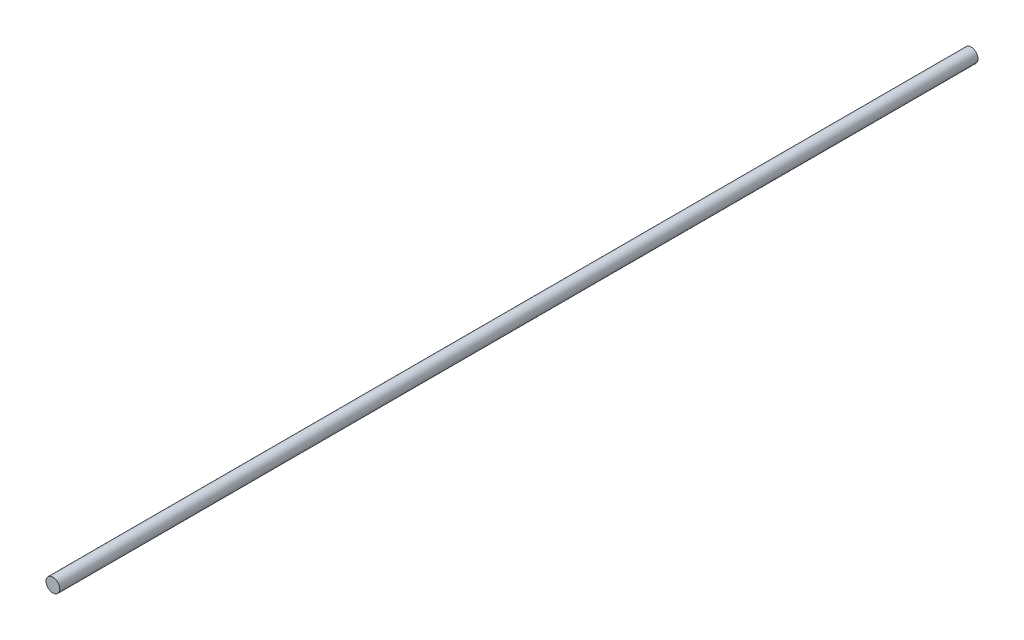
from build123d import *

# Parameters (mm, degrees)
SKETCH1_R      = 4.7625
EXTRUDE1_DEPTH = 635


with BuildPart() as part:
    # Sketch1 → Extrude1 (new body)
    with BuildSketch(Plane.XY):
        with Locations(Location((0, 0, 0), (0, 0, 180))):
            Circle(SKETCH1_R)
    extrude(amount=EXTRUDE1_DEPTH)


solid = part.part
